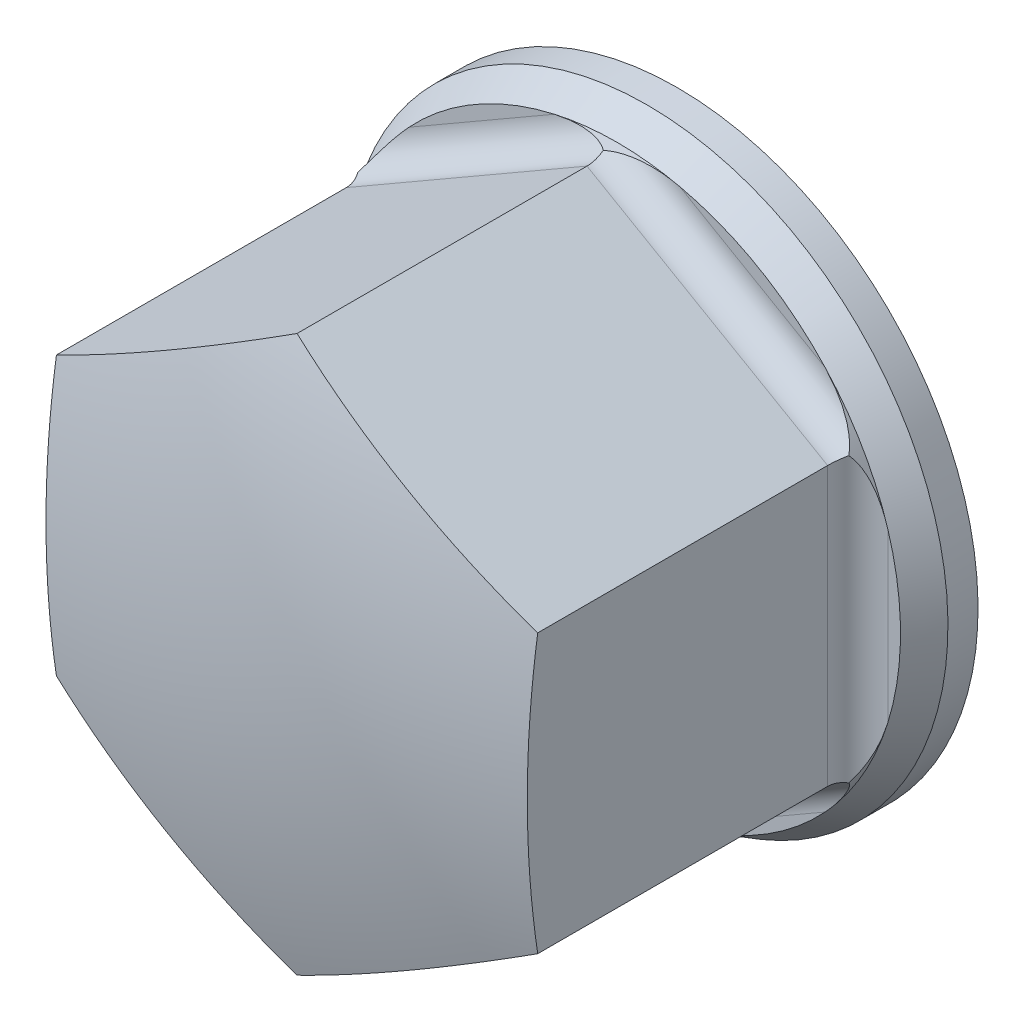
ISO-10303-21;
HEADER;
FILE_DESCRIPTION(('STEP AP214'),'2;1');
FILE_NAME('part.step','',(''),(''),'','','');
FILE_SCHEMA(('AUTOMOTIVE_DESIGN { 1 0 10303 214 1 1 1 1 }'));
ENDSEC;
DATA;
#1=APPLICATION_CONTEXT('core data for automotive mechanical design processes');
#2=APPLICATION_PROTOCOL_DEFINITION('international standard','automotive_design',2000,#1);
#3=PRODUCT_CONTEXT('',#1,'mechanical');
#4=PRODUCT('Part','Part','',(#3));
#5=PRODUCT_RELATED_PRODUCT_CATEGORY('part','',(#4));
#6=PRODUCT_DEFINITION_FORMATION('','',#4);
#7=PRODUCT_DEFINITION_CONTEXT('part definition',#1,'design');
#8=PRODUCT_DEFINITION('design','',#6,#7);
#9=PRODUCT_DEFINITION_SHAPE('','',#8);
#10=(LENGTH_UNIT() NAMED_UNIT(*) SI_UNIT(.MILLI.,.METRE.));
#11=(NAMED_UNIT(*) PLANE_ANGLE_UNIT() SI_UNIT($,.RADIAN.));
#12=(NAMED_UNIT(*) SI_UNIT($,.STERADIAN.) SOLID_ANGLE_UNIT());
#13=UNCERTAINTY_MEASURE_WITH_UNIT(LENGTH_MEASURE(1.E-05),#10,'distance_accuracy_value','');
#14=(GEOMETRIC_REPRESENTATION_CONTEXT(3) GLOBAL_UNCERTAINTY_ASSIGNED_CONTEXT((#13)) GLOBAL_UNIT_ASSIGNED_CONTEXT((#10,
#11,#12)) REPRESENTATION_CONTEXT('',''));
#15=CARTESIAN_POINT('',(0.,0.,0.));
#16=DIRECTION('',(0.,0.,1.));
#17=DIRECTION('',(1.,0.,0.));
#18=AXIS2_PLACEMENT_3D('',#15,#16,#17);
#19=CARTESIAN_POINT('',(0.,0.,0.));
#20=DIRECTION('',(0.,0.,-1.));
#21=DIRECTION('',(0.,1.,0.));
#22=AXIS2_PLACEMENT_3D('',#19,#20,#21);
#23=CYLINDRICAL_SURFACE('',#22,5.);
#24=CARTESIAN_POINT('',(0.,0.,0.));
#25=DIRECTION('',(0.,0.,-1.));
#26=DIRECTION('',(0.,1.,0.));
#27=AXIS2_PLACEMENT_3D('',#24,#25,#26);
#28=CIRCLE('',#27,5.);
#29=CARTESIAN_POINT('',(0.,5.,0.));
#30=VERTEX_POINT('',#29);
#31=EDGE_CURVE('E175',#30,#30,#28,.T.);
#32=ORIENTED_EDGE('',*,*,#31,.F.);
#33=EDGE_LOOP('',(#32));
#34=FACE_BOUND('',#33,.T.);
#35=CARTESIAN_POINT('',(0.,0.,0.5));
#36=DIRECTION('',(0.,0.,-1.));
#37=DIRECTION('',(0.,1.,0.));
#38=AXIS2_PLACEMENT_3D('',#35,#36,#37);
#39=CIRCLE('',#38,5.);
#40=CARTESIAN_POINT('',(0.,5.,0.5));
#41=VERTEX_POINT('',#40);
#42=EDGE_CURVE('E140',#41,#41,#39,.T.);
#43=ORIENTED_EDGE('',*,*,#42,.T.);
#44=EDGE_LOOP('',(#43));
#45=FACE_BOUND('',#44,.T.);
#46=ADVANCED_FACE('F14',(#34,#45),#23,.T.);
#47=CARTESIAN_POINT('',(5.,0.,0.));
#48=DIRECTION('',(0.,0.,1.));
#49=DIRECTION('',(0.,-1.,0.));
#50=AXIS2_PLACEMENT_3D('',#47,#48,#49);
#51=PLANE('',#50);
#52=CARTESIAN_POINT('',(0.,0.,0.));
#53=DIRECTION('',(0.,0.,-1.));
#54=DIRECTION('',(0.,1.,0.));
#55=AXIS2_PLACEMENT_3D('',#52,#53,#54);
#56=CIRCLE('',#55,2.5);
#57=CARTESIAN_POINT('',(0.,2.5,0.));
#58=VERTEX_POINT('',#57);
#59=EDGE_CURVE('E330',#58,#58,#56,.T.);
#60=ORIENTED_EDGE('',*,*,#59,.F.);
#61=EDGE_LOOP('',(#60));
#62=FACE_BOUND('',#61,.T.);
#63=ORIENTED_EDGE('',*,*,#31,.T.);
#64=EDGE_LOOP('',(#63));
#65=FACE_BOUND('',#64,.T.);
#66=ADVANCED_FACE('F314',(#62,#65),#51,.F.);
#67=CARTESIAN_POINT('',(0.,0.,0.5));
#68=DIRECTION('',(0.,0.,-1.));
#69=DIRECTION('',(0.,1.,0.));
#70=AXIS2_PLACEMENT_3D('',#67,#68,#69);
#71=CYLINDRICAL_SURFACE('',#70,4.71132486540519);
#72=CARTESIAN_POINT('',(-4.,-2.48929347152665,1.5));
#73=CARTESIAN_POINT('',(-3.99997918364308,-2.48932287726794,1.48424472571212));
#74=CARTESIAN_POINT('',(-4.00074354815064,-2.48809880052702,1.46852756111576));
#75=CARTESIAN_POINT('',(-4.00366322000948,-2.48339998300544,1.43769489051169));
#76=CARTESIAN_POINT('',(-4.00580690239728,-2.47994405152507,1.42257546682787));
#77=CARTESIAN_POINT('',(-4.01130363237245,-2.47104237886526,1.39322819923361));
#78=CARTESIAN_POINT('',(-4.01465339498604,-2.46560204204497,1.3789980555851));
#79=CARTESIAN_POINT('',(-4.02233194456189,-2.45305576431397,1.35155294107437));
#80=CARTESIAN_POINT('',(-4.02666286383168,-2.44594619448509,1.33834026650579));
#81=CARTESIAN_POINT('',(-4.03907925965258,-2.42541534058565,1.30495689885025));
#82=CARTESIAN_POINT('',(-4.04779819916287,-2.41085964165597,1.28571992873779));
#83=CARTESIAN_POINT('',(-4.06645650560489,-2.37925502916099,1.2501084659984));
#84=CARTESIAN_POINT('',(-4.07639907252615,-2.36219955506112,1.23374176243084));
#85=CARTESIAN_POINT('',(-4.10404035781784,-2.31400950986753,1.19312423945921));
#86=CARTESIAN_POINT('',(-4.12236112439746,-2.28127419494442,1.17121580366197));
#87=CARTESIAN_POINT('',(-4.15942781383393,-2.21297769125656,1.13295888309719));
#88=CARTESIAN_POINT('',(-4.17817464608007,-2.17740995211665,1.11662377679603));
#89=CARTESIAN_POINT('',(-4.21536503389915,-2.10450779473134,1.08826246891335));
#90=CARTESIAN_POINT('',(-4.23380874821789,-2.06717434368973,1.07623393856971));
#91=CARTESIAN_POINT('',(-4.27004013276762,-1.99125911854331,1.05552987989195));
#92=CARTESIAN_POINT('',(-4.28782710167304,-1.95267608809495,1.04685784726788));
#93=CARTESIAN_POINT('',(-4.32255816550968,-1.87454137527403,1.03216421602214));
#94=CARTESIAN_POINT('',(-4.33950025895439,-1.83498769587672,1.02614866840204));
#95=CARTESIAN_POINT('',(-4.37238200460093,-1.75519828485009,1.01625633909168));
#96=CARTESIAN_POINT('',(-4.38832138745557,-1.71496237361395,1.01238012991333));
#97=CARTESIAN_POINT('',(-4.42125584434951,-1.62834627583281,1.00591513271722));
#98=CARTESIAN_POINT('',(-4.43809110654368,-1.58188732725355,1.00357919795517));
#99=CARTESIAN_POINT('',(-4.47019133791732,-1.48875297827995,1.00063569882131));
#100=CARTESIAN_POINT('',(-4.48546687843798,-1.44208163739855,1.00001563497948));
#101=CARTESIAN_POINT('',(-4.5,-1.39519962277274,1.));
#102=B_SPLINE_CURVE_WITH_KNOTS('',3,(#72,#73,#74,#75,#76,#77,#78,#79,#80,#81,#82,#83,#84,#85,
#86,#87,#88,#89,#90,#91,#92,#93,#94,#95,#96,#97,#98,#99,#100,#101),.UNSPECIFIED.,.F.,.F.,(4,2,2,
2,2,2,2,2,2,2,2,2,2,2,4),(0.,0.0471392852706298,0.0938863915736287,0.140507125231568,
0.187230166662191,0.263737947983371,0.340450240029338,0.470043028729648,0.599944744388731,
0.729776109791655,0.85974232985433,0.990003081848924,1.12029867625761,1.26865074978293,
1.41591925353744),.UNSPECIFIED.);
#103=CARTESIAN_POINT('',(-4.08012701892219,-2.3556624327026,1.22851025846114));
#104=VERTEX_POINT('',#103);
#105=CARTESIAN_POINT('',(-4.5,-1.39519962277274,1.));
#106=VERTEX_POINT('',#105);
#107=EDGE_CURVE('E270',#104,#106,#102,.T.);
#108=ORIENTED_EDGE('',*,*,#107,.T.);
#109=CARTESIAN_POINT('',(0.,0.,1.));
#110=DIRECTION('',(0.,0.,-1.));
#111=DIRECTION('',(0.,1.,0.));
#112=AXIS2_PLACEMENT_3D('',#109,#110,#111);
#113=CIRCLE('',#112,4.71132486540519);
#114=CARTESIAN_POINT('',(-3.45827831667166,-3.1995145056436,1.));
#115=VERTEX_POINT('',#114);
#116=EDGE_CURVE('E573',#115,#106,#113,.T.);
#117=ORIENTED_EDGE('',*,*,#116,.F.);
#118=CARTESIAN_POINT('',(-3.45827831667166,-3.1995145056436,1.));
#119=CARTESIAN_POINT('',(-3.49441343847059,-3.16046171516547,1.00002190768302));
#120=CARTESIAN_POINT('',(-3.52989942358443,-3.12077392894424,1.00074736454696));
#121=CARTESIAN_POINT('',(-3.59957617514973,-3.04014366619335,1.00424018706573));
#122=CARTESIAN_POINT('',(-3.63376234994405,-2.99919752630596,1.00701419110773));
#123=CARTESIAN_POINT('',(-3.7006224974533,-2.91630134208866,1.01524905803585));
#124=CARTESIAN_POINT('',(-3.73329570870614,-2.87435080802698,1.02071125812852));
#125=CARTESIAN_POINT('',(-3.79689141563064,-2.78980048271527,1.03517070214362));
#126=CARTESIAN_POINT('',(-3.8278164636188,-2.74720175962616,1.04416263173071));
#127=CARTESIAN_POINT('',(-3.87835249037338,-2.6751177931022,1.06330446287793));
#128=CARTESIAN_POINT('',(-3.89848923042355,-2.64567751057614,1.07222298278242));
#129=CARTESIAN_POINT('',(-3.93772922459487,-2.58691346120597,1.09283245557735));
#130=CARTESIAN_POINT('',(-3.95682903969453,-2.55759034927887,1.10453201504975));
#131=CARTESIAN_POINT('',(-3.99818665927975,-2.49257022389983,1.13459722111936));
#132=CARTESIAN_POINT('',(-4.02008068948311,-2.45706015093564,1.15389240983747));
#133=CARTESIAN_POINT('',(-4.06092993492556,-2.3889274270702,1.19940978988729));
#134=CARTESIAN_POINT('',(-4.07990319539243,-2.35628762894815,1.22558649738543));
#135=CARTESIAN_POINT('',(-4.10358967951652,-2.31459362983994,1.26905204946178));
#136=CARTESIAN_POINT('',(-4.11019504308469,-2.30283258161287,1.28270089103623));
#137=CARTESIAN_POINT('',(-4.12238708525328,-2.28093436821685,1.3116982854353));
#138=CARTESIAN_POINT('',(-4.1279732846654,-2.27079796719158,1.32704763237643));
#139=CARTESIAN_POINT('',(-4.1379074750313,-2.25264577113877,1.35961661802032));
#140=CARTESIAN_POINT('',(-4.14223932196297,-2.24465771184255,1.37685701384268));
#141=CARTESIAN_POINT('',(-4.14922772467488,-2.23171382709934,1.41274118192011));
#142=CARTESIAN_POINT('',(-4.15189013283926,-2.22674741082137,1.43137979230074));
#143=CARTESIAN_POINT('',(-4.15431668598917,-2.22221441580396,1.45855204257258));
#144=CARTESIAN_POINT('',(-4.15486784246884,-2.22118348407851,1.46679129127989));
#145=CARTESIAN_POINT('',(-4.15560561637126,-2.21980276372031,1.48335162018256));
#146=CARTESIAN_POINT('',(-4.15579184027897,-2.21945371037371,1.4916727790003));
#147=CARTESIAN_POINT('',(-4.15579138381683,-2.21945487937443,1.5));
#148=B_SPLINE_CURVE_WITH_KNOTS('',3,(#118,#119,#120,#121,#122,#123,#124,#125,#126,#127,#128,
#129,#130,#131,#132,#133,#134,#135,#136,#137,#138,#139,#140,#141,#142,#143,#144,#145,#146,#147),
.UNSPECIFIED.,.F.,.F.,(4,2,2,2,2,2,2,2,2,2,2,2,2,2,4),(0.,0.159644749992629,0.319809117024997,
0.480053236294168,0.640057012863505,0.750263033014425,0.860814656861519,0.998290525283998,
1.13487963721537,1.19231630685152,1.24977991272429,1.30795319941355,1.36592139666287,
1.39085531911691,1.41581611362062),.UNSPECIFIED.);
#149=EDGE_CURVE('E265',#115,#104,#148,.T.);
#150=ORIENTED_EDGE('',*,*,#149,.T.);
#151=EDGE_LOOP('',(#108,#117,#150));
#152=FACE_BOUND('',#151,.T.);
#153=ADVANCED_FACE('F199',(#152),#71,.T.);
#154=CARTESIAN_POINT('',(4.,2.48929347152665,1.5));
#155=CARTESIAN_POINT('',(3.99997918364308,2.48932287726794,1.48424472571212));
#156=CARTESIAN_POINT('',(4.00074354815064,2.48809880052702,1.46852756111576));
#157=CARTESIAN_POINT('',(4.00366322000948,2.48339998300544,1.43769489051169));
#158=CARTESIAN_POINT('',(4.00580690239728,2.47994405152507,1.42257546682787));
#159=CARTESIAN_POINT('',(4.01130363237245,2.47104237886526,1.39322819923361));
#160=CARTESIAN_POINT('',(4.01465339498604,2.46560204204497,1.3789980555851));
#161=CARTESIAN_POINT('',(4.02233194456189,2.45305576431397,1.35155294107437));
#162=CARTESIAN_POINT('',(4.02666286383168,2.44594619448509,1.33834026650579));
#163=CARTESIAN_POINT('',(4.03907925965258,2.42541534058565,1.30495689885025));
#164=CARTESIAN_POINT('',(4.04779819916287,2.41085964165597,1.28571992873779));
#165=CARTESIAN_POINT('',(4.06645650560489,2.37925502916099,1.2501084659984));
#166=CARTESIAN_POINT('',(4.07639907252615,2.36219955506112,1.23374176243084));
#167=CARTESIAN_POINT('',(4.10404035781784,2.31400950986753,1.19312423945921));
#168=CARTESIAN_POINT('',(4.12236112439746,2.28127419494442,1.17121580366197));
#169=CARTESIAN_POINT('',(4.15942781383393,2.21297769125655,1.13295888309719));
#170=CARTESIAN_POINT('',(4.17817464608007,2.17740995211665,1.11662377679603));
#171=CARTESIAN_POINT('',(4.21536503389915,2.10450779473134,1.08826246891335));
#172=CARTESIAN_POINT('',(4.23380874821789,2.06717434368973,1.07623393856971));
#173=CARTESIAN_POINT('',(4.27004013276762,1.99125911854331,1.05552987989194));
#174=CARTESIAN_POINT('',(4.28782710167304,1.95267608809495,1.04685784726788));
#175=CARTESIAN_POINT('',(4.32255816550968,1.87454137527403,1.03216421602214));
#176=CARTESIAN_POINT('',(4.33950025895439,1.83498769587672,1.02614866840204));
#177=CARTESIAN_POINT('',(4.37238200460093,1.75519828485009,1.01625633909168));
#178=CARTESIAN_POINT('',(4.38832138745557,1.71496237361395,1.01238012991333));
#179=CARTESIAN_POINT('',(4.42125584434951,1.62834627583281,1.00591513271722));
#180=CARTESIAN_POINT('',(4.43809110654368,1.58188732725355,1.00357919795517));
#181=CARTESIAN_POINT('',(4.47019133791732,1.48875297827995,1.00063569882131));
#182=CARTESIAN_POINT('',(4.48546687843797,1.44208163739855,1.00001563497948));
#183=CARTESIAN_POINT('',(4.5,1.39519962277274,1.));
#184=B_SPLINE_CURVE_WITH_KNOTS('',3,(#154,#155,#156,#157,#158,#159,#160,#161,#162,#163,#164,
#165,#166,#167,#168,#169,#170,#171,#172,#173,#174,#175,#176,#177,#178,#179,#180,#181,#182,#183),
.UNSPECIFIED.,.F.,.F.,(4,2,2,2,2,2,2,2,2,2,2,2,2,2,4),(0.,0.0471392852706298,0.0938863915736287,
0.140507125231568,0.187230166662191,0.263737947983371,0.340450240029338,0.47004302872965,
0.599944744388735,0.729776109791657,0.85974232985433,0.990003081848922,1.1202986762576,
1.26865074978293,1.41591925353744),.UNSPECIFIED.);
#185=CARTESIAN_POINT('',(4.08012701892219,2.35566243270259,1.22851025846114));
#186=VERTEX_POINT('',#185);
#187=CARTESIAN_POINT('',(4.5,1.39519962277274,1.));
#188=VERTEX_POINT('',#187);
#189=EDGE_CURVE('E259',#186,#188,#184,.T.);
#190=ORIENTED_EDGE('',*,*,#189,.T.);
#191=CARTESIAN_POINT('',(3.45827831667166,3.1995145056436,1.));
#192=VERTEX_POINT('',#191);
#193=EDGE_CURVE('E136',#192,#188,#113,.T.);
#194=ORIENTED_EDGE('',*,*,#193,.F.);
#195=CARTESIAN_POINT('',(3.45827831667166,3.19951450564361,1.));
#196=CARTESIAN_POINT('',(3.49441343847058,3.16046171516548,1.00002190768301));
#197=CARTESIAN_POINT('',(3.52989942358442,3.12077392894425,1.00074736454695));
#198=CARTESIAN_POINT('',(3.59957617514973,3.04014366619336,1.00424018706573));
#199=CARTESIAN_POINT('',(3.63376234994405,2.99919752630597,1.00701419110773));
#200=CARTESIAN_POINT('',(3.7006224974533,2.91630134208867,1.01524905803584));
#201=CARTESIAN_POINT('',(3.73329570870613,2.87435080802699,1.02071125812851));
#202=CARTESIAN_POINT('',(3.79689141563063,2.78980048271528,1.03517070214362));
#203=CARTESIAN_POINT('',(3.82781646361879,2.74720175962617,1.04416263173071));
#204=CARTESIAN_POINT('',(3.87835249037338,2.6751177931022,1.06330446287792));
#205=CARTESIAN_POINT('',(3.89848923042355,2.64567751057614,1.0722229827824));
#206=CARTESIAN_POINT('',(3.93772922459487,2.58691346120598,1.09283245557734));
#207=CARTESIAN_POINT('',(3.95682903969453,2.55759034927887,1.10453201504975));
#208=CARTESIAN_POINT('',(3.99818665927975,2.49257022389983,1.13459722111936));
#209=CARTESIAN_POINT('',(4.02008068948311,2.45706015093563,1.15389240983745));
#210=CARTESIAN_POINT('',(4.06092993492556,2.3889274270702,1.19940978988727));
#211=CARTESIAN_POINT('',(4.07990319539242,2.35628762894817,1.22558649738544));
#212=CARTESIAN_POINT('',(4.10358967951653,2.31459362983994,1.26905204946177));
#213=CARTESIAN_POINT('',(4.1101950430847,2.30283258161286,1.28270089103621));
#214=CARTESIAN_POINT('',(4.12238708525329,2.28093436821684,1.31169828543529));
#215=CARTESIAN_POINT('',(4.1279732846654,2.27079796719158,1.32704763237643));
#216=CARTESIAN_POINT('',(4.1379074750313,2.25264577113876,1.35961661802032));
#217=CARTESIAN_POINT('',(4.14223932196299,2.24465771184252,1.37685701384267));
#218=CARTESIAN_POINT('',(4.14922772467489,2.23171382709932,1.4127411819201));
#219=CARTESIAN_POINT('',(4.15189013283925,2.22674741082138,1.43137979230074));
#220=CARTESIAN_POINT('',(4.15431668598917,2.22221441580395,1.45855204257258));
#221=CARTESIAN_POINT('',(4.15486784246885,2.22118348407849,1.46679129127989));
#222=CARTESIAN_POINT('',(4.15560561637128,2.21980276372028,1.48335162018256));
#223=CARTESIAN_POINT('',(4.15579184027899,2.21945371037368,1.49167277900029));
#224=CARTESIAN_POINT('',(4.15579138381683,2.21945487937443,1.5));
#225=B_SPLINE_CURVE_WITH_KNOTS('',3,(#195,#196,#197,#198,#199,#200,#201,#202,#203,#204,#205,
#206,#207,#208,#209,#210,#211,#212,#213,#214,#215,#216,#217,#218,#219,#220,#221,#222,#223,#224),
.UNSPECIFIED.,.F.,.F.,(4,2,2,2,2,2,2,2,2,2,2,2,2,2,4),(0.,0.159644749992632,0.319809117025,
0.480053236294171,0.640057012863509,0.750263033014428,0.860814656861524,0.998290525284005,
1.13487963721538,1.19231630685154,1.24977991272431,1.30795319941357,1.3659213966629,
1.39085531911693,1.41581611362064),.UNSPECIFIED.);
#226=EDGE_CURVE('E253',#192,#186,#225,.T.);
#227=ORIENTED_EDGE('',*,*,#226,.T.);
#228=EDGE_LOOP('',(#190,#194,#227));
#229=FACE_BOUND('',#228,.T.);
#230=ADVANCED_FACE('F483',(#229),#71,.T.);
#231=CARTESIAN_POINT('',(-4.5,1.39519962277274,1.));
#232=CARTESIAN_POINT('',(-4.48424685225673,1.44601995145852,1.00002190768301));
#233=CARTESIAN_POINT('',(-4.4676192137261,1.49659560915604,1.00074736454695));
#234=CARTESIAN_POINT('',(-4.43262973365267,1.59725257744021,1.00424018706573));
#235=CARTESIAN_POINT('',(-4.41426242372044,1.647331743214,1.00701419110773));
#236=CARTESIAN_POINT('',(-4.37590229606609,1.74668242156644,1.01524905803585));
#237=CARTESIAN_POINT('',(-4.35590867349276,1.79595351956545,1.02071125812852));
#238=CARTESIAN_POINT('',(-4.31448379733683,1.89330417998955,1.03517070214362));
#239=CARTESIAN_POINT('',(-4.29305474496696,1.9413854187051,1.04416263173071));
#240=CARTESIAN_POINT('',(-4.25589621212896,2.02119288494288,1.06330446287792));
#241=CARTESIAN_POINT('',(-4.24046854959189,2.05335195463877,1.07222298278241));
#242=CARTESIAN_POINT('',(-4.20919738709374,2.11671681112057,1.09283245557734));
#243=CARTESIAN_POINT('',(-4.19335273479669,2.14791929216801,1.10453201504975));
#244=CARTESIAN_POINT('',(-4.15772246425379,2.21624610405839,1.13459722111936));
#245=CARTESIAN_POINT('',(-4.13791685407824,2.25296192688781,1.15389240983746));
#246=CARTESIAN_POINT('',(-4.09933680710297,2.32240477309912,1.19940978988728));
#247=CARTESIAN_POINT('',(-4.08055654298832,2.35515599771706,1.22558649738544));
#248=CARTESIAN_POINT('',(-4.05629172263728,2.39651609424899,1.26905204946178));
#249=CARTESIAN_POINT('',(-4.04940903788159,2.40811703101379,1.28270089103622));
#250=CARTESIAN_POINT('',(-4.03654064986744,2.42962475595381,1.31169828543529));
#251=CARTESIAN_POINT('',(-4.03055536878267,2.43953074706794,1.32704763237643));
#252=CARTESIAN_POINT('',(-4.0198022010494,2.45721010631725,1.35961661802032));
#253=CARTESIAN_POINT('',(-4.01505026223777,2.46495562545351,1.37685701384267));
#254=CARTESIAN_POINT('',(-4.00733473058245,2.4774797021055,1.4127411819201));
#255=CARTESIAN_POINT('',(-4.00436489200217,2.48226862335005,1.43137979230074));
#256=CARTESIAN_POINT('',(-4.0016524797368,2.48663657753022,1.45855204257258));
#257=CARTESIAN_POINT('',(-4.00103524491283,2.48762935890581,1.46679129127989));
#258=CARTESIAN_POINT('',(-4.00020839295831,2.48895865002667,1.48335162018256));
#259=CARTESIAN_POINT('',(-3.99999921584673,2.48929445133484,1.49167277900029));
#260=CARTESIAN_POINT('',(-4.,2.48929347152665,1.5));
#261=B_SPLINE_CURVE_WITH_KNOTS('',3,(#231,#232,#233,#234,#235,#236,#237,#238,#239,#240,#241,
#242,#243,#244,#245,#246,#247,#248,#249,#250,#251,#252,#253,#254,#255,#256,#257,#258,#259,#260),
.UNSPECIFIED.,.F.,.F.,(4,2,2,2,2,2,2,2,2,2,2,2,2,2,4),(0.,0.159644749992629,0.319809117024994,
0.480053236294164,0.640057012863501,0.750263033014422,0.860814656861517,0.998290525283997,
1.13487963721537,1.19231630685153,1.2497799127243,1.30795319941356,1.36592139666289,
1.39085531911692,1.41581611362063),.UNSPECIFIED.);
#262=CARTESIAN_POINT('',(-4.5,1.39519962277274,1.));
#263=VERTEX_POINT('',#262);
#264=CARTESIAN_POINT('',(-4.0801270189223,2.35566243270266,1.22851025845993));
#265=VERTEX_POINT('',#264);
#266=EDGE_CURVE('E245',#263,#265,#261,.T.);
#267=ORIENTED_EDGE('',*,*,#266,.T.);
#268=CARTESIAN_POINT('',(-4.15579138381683,2.21945487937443,1.5));
#269=CARTESIAN_POINT('',(-4.15580644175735,2.21942214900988,1.48424472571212));
#270=CARTESIAN_POINT('',(-4.15512854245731,2.22069614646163,1.46852756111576));
#271=CARTESIAN_POINT('',(-4.15251908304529,2.22557406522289,1.43769489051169));
#272=CARTESIAN_POINT('',(-4.15059799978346,2.22915851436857,1.42257546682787));
#273=CARTESIAN_POINT('',(-4.14563729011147,2.2383696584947,1.39322819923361));
#274=CARTESIAN_POINT('',(-4.14260070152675,2.24399080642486,1.3789980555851));
#275=CARTESIAN_POINT('',(-4.1355745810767,2.25691376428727,1.35155294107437));
#276=CARTESIAN_POINT('',(-4.1315829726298,2.26421923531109,1.33834026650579));
#277=CARTESIAN_POINT('',(-4.12001092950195,2.28523757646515,1.30495689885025));
#278=CARTESIAN_POINT('',(-4.11176479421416,2.30006624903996,1.28571992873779));
#279=CARTESIAN_POINT('',(-4.09372355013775,2.33202712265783,1.25010846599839));
#280=CARTESIAN_POINT('',(-4.0839243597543,2.34916537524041,1.23374176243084));
#281=CARTESIAN_POINT('',(-4.05601119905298,2.39719845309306,1.19312423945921));
#282=CARTESIAN_POINT('',(-4.03682196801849,2.42943235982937,1.17121580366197));
#283=CARTESIAN_POINT('',(-3.99620880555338,2.49568130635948,1.13295888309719));
#284=CARTESIAN_POINT('',(-3.97477965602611,2.52970040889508,1.11662377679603));
#285=CARTESIAN_POINT('',(-3.93023972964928,2.59835930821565,1.08826246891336));
#286=CARTESIAN_POINT('',(-3.90712986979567,2.63299875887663,1.0762339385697));
#287=CARTESIAN_POINT('',(-3.85950104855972,2.70233367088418,1.05552987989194));
#288=CARTESIAN_POINT('',(-3.83498064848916,2.73702915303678,1.04685784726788));
#289=CARTESIAN_POINT('',(-3.78467953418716,2.80617449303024,1.03216421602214));
#290=CARTESIAN_POINT('',(-3.75889608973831,2.8406236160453,1.02614866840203));
#291=CARTESIAN_POINT('',(-3.70623730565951,2.9089947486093,1.01625633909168));
#292=CARTESIAN_POINT('',(-3.67936167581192,2.94291661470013,1.01238012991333));
#293=CARTESIAN_POINT('',(-3.62081716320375,3.0147467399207,1.00591513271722));
#294=CARTESIAN_POINT('',(-3.58900016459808,3.05255597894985,1.00357919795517));
#295=CARTESIAN_POINT('',(-3.52439356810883,3.12692276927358,1.00063569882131));
#296=CARTESIAN_POINT('',(-3.49161277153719,3.1634874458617,1.00001563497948));
#297=CARTESIAN_POINT('',(-3.45827831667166,3.19951450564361,1.));
#298=B_SPLINE_CURVE_WITH_KNOTS('',3,(#268,#269,#270,#271,#272,#273,#274,#275,#276,#277,#278,
#279,#280,#281,#282,#283,#284,#285,#286,#287,#288,#289,#290,#291,#292,#293,#294,#295,#296,#297),
.UNSPECIFIED.,.F.,.F.,(4,2,2,2,2,2,2,2,2,2,2,2,2,2,4),(0.,0.0471392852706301,0.0938863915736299,
0.140507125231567,0.187230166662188,0.26373794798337,0.340450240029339,0.470043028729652,
0.599944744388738,0.729776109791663,0.859742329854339,0.990003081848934,1.12029867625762,
1.26865074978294,1.41591925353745),.UNSPECIFIED.);
#299=CARTESIAN_POINT('',(-3.45827831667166,3.19951450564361,1.));
#300=VERTEX_POINT('',#299);
#301=EDGE_CURVE('E238',#265,#300,#298,.T.);
#302=ORIENTED_EDGE('',*,*,#301,.T.);
#303=EDGE_CURVE('E587',#263,#300,#113,.T.);
#304=ORIENTED_EDGE('',*,*,#303,.F.);
#305=EDGE_LOOP('',(#267,#302,#304));
#306=FACE_BOUND('',#305,.T.);
#307=ADVANCED_FACE('F476',(#306),#71,.T.);
#308=CARTESIAN_POINT('',(-0.155791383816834,4.70874835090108,1.5));
#309=CARTESIAN_POINT('',(-0.155827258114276,4.70874502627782,1.48424472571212));
#310=CARTESIAN_POINT('',(-0.154384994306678,4.70879494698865,1.46852756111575));
#311=CARTESIAN_POINT('',(-0.148855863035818,4.70897404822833,1.43769489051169));
#312=CARTESIAN_POINT('',(-0.144791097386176,4.70910256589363,1.42257546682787));
#313=CARTESIAN_POINT('',(-0.134333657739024,4.70941203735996,1.39322819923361));
#314=CARTESIAN_POINT('',(-0.127947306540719,4.70959284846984,1.3789980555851));
#315=CARTESIAN_POINT('',(-0.113242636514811,4.70996952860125,1.35155294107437));
#316=CARTESIAN_POINT('',(-0.104920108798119,4.71016542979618,1.33834026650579));
#317=CARTESIAN_POINT('',(-0.0809316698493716,4.7106529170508,1.30495689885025));
#318=CARTESIAN_POINT('',(-0.0639665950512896,4.71092589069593,1.28571992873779));
#319=CARTESIAN_POINT('',(-0.0272670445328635,4.71128215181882,1.25010846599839));
#320=CARTESIAN_POINT('',(-0.00752528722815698,4.71136493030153,1.23374176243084));
#321=CARTESIAN_POINT('',(0.048029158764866,4.71120796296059,1.19312423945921));
#322=CARTESIAN_POINT('',(0.0855391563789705,4.71070655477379,1.17121580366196));
#323=CARTESIAN_POINT('',(0.163219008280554,4.70865899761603,1.13295888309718));
#324=CARTESIAN_POINT('',(0.203394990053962,4.70711036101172,1.11662377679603));
#325=CARTESIAN_POINT('',(0.285125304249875,4.70286710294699,1.08826246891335));
#326=CARTESIAN_POINT('',(0.326678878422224,4.70017310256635,1.0762339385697));
#327=CARTESIAN_POINT('',(0.410539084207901,4.69359278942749,1.05552987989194));
#328=CARTESIAN_POINT('',(0.452846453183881,4.68970524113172,1.04685784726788));
#329=CARTESIAN_POINT('',(0.537878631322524,4.68071586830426,1.03216421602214));
#330=CARTESIAN_POINT('',(0.580604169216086,4.67561131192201,1.02614866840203));
#331=CARTESIAN_POINT('',(0.666144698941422,4.66419303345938,1.01625633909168));
#332=CARTESIAN_POINT('',(0.708959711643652,4.65787898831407,1.01238012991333));
#333=CARTESIAN_POINT('',(0.800438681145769,4.6430930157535,1.00591513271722));
#334=CARTESIAN_POINT('',(0.849090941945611,4.63444330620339,1.00357919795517));
#335=CARTESIAN_POINT('',(0.945797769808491,4.61567574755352,1.00063569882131));
#336=CARTESIAN_POINT('',(0.99385410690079,4.60556908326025,1.00001563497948));
#337=CARTESIAN_POINT('',(1.04172168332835,4.59471412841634,1.));
#338=B_SPLINE_CURVE_WITH_KNOTS('',3,(#308,#309,#310,#311,#312,#313,#314,#315,#316,#317,#318,
#319,#320,#321,#322,#323,#324,#325,#326,#327,#328,#329,#330,#331,#332,#333,#334,#335,#336,#337),
.UNSPECIFIED.,.F.,.F.,(4,2,2,2,2,2,2,2,2,2,2,2,2,2,4),(0.,0.0471392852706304,0.0938863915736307,
0.14050712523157,0.187230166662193,0.263737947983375,0.340450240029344,0.470043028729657,
0.599944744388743,0.729776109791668,0.859742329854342,0.990003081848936,1.12029867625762,
1.26865074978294,1.41591925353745),.UNSPECIFIED.);
#339=CARTESIAN_POINT('',(0.,4.71132486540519,1.22851025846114));
#340=VERTEX_POINT('',#339);
#341=CARTESIAN_POINT('',(1.04172168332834,4.59471412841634,1.));
#342=VERTEX_POINT('',#341);
#343=EDGE_CURVE('E230',#340,#342,#338,.T.);
#344=ORIENTED_EDGE('',*,*,#343,.T.);
#345=CARTESIAN_POINT('',(-1.04172168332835,4.59471412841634,1.));
#346=VERTEX_POINT('',#345);
#347=EDGE_CURVE('E653',#346,#342,#113,.T.);
#348=ORIENTED_EDGE('',*,*,#347,.F.);
#349=CARTESIAN_POINT('',(-1.04172168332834,4.59471412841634,1.));
#350=CARTESIAN_POINT('',(-0.989833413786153,4.60648166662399,1.00002190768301));
#351=CARTESIAN_POINT('',(-0.937719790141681,4.61736953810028,1.00074736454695));
#352=CARTESIAN_POINT('',(-0.833053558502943,4.63739624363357,1.00424018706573));
#353=CARTESIAN_POINT('',(-0.780500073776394,4.64652926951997,1.00701419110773));
#354=CARTESIAN_POINT('',(-0.675279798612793,4.6629837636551,1.01524905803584));
#355=CARTESIAN_POINT('',(-0.622612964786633,4.67030432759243,1.02071125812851));
#356=CARTESIAN_POINT('',(-0.517592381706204,4.68310466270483,1.03517070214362));
#357=CARTESIAN_POINT('',(-0.465238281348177,4.68858717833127,1.04416263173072));
#358=CARTESIAN_POINT('',(-0.377543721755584,4.69631067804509,1.06330446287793));
#359=CARTESIAN_POINT('',(-0.341979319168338,4.69902946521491,1.07222298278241));
#360=CARTESIAN_POINT('',(-0.271468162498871,4.70363027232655,1.09283245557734));
#361=CARTESIAN_POINT('',(-0.236523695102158,4.70550964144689,1.10453201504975));
#362=CARTESIAN_POINT('',(-0.159535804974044,4.70881632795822,1.13459722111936));
#363=CARTESIAN_POINT('',(-0.117836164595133,4.71002207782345,1.15389240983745));
#364=CARTESIAN_POINT('',(-0.0384068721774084,4.71133220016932,1.19940978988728));
#365=CARTESIAN_POINT('',(-0.000653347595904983,4.71144362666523,1.22558649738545));
#366=CARTESIAN_POINT('',(0.0472979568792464,4.71110972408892,1.26905204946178));
#367=CARTESIAN_POINT('',(0.0607860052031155,4.71094961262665,1.28270089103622));
#368=CARTESIAN_POINT('',(0.0858464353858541,4.71055912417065,1.31169828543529));
#369=CARTESIAN_POINT('',(0.097417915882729,4.71032871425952,1.32704763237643));
#370=CARTESIAN_POINT('',(0.118105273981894,4.70985587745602,1.35961661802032));
#371=CARTESIAN_POINT('',(0.12718905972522,4.70961333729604,1.37685701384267));
#372=CARTESIAN_POINT('',(0.141892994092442,4.70919352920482,1.41274118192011));
#373=CARTESIAN_POINT('',(0.147525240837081,4.70901603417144,1.43137979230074));
#374=CARTESIAN_POINT('',(0.152664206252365,4.70885099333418,1.45855204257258));
#375=CARTESIAN_POINT('',(0.153832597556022,4.70881284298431,1.46679129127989));
#376=CARTESIAN_POINT('',(0.155397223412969,4.70876141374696,1.48335162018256));
#377=CARTESIAN_POINT('',(0.155792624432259,4.70874816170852,1.49167277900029));
#378=CARTESIAN_POINT('',(0.155791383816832,4.70874835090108,1.5));
#379=B_SPLINE_CURVE_WITH_KNOTS('',3,(#349,#350,#351,#352,#353,#354,#355,#356,#357,#358,#359,
#360,#361,#362,#363,#364,#365,#366,#367,#368,#369,#370,#371,#372,#373,#374,#375,#376,#377,#378),
.UNSPECIFIED.,.F.,.F.,(4,2,2,2,2,2,2,2,2,2,2,2,2,2,4),(0.,0.15964474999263,0.319809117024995,
0.480053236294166,0.640057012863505,0.750263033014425,0.86081465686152,0.998290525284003,
1.13487963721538,1.19231630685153,1.24977991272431,1.30795319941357,1.36592139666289,
1.39085531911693,1.41581611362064),.UNSPECIFIED.);
#380=EDGE_CURVE('E223',#346,#340,#379,.T.);
#381=ORIENTED_EDGE('',*,*,#380,.T.);
#382=EDGE_LOOP('',(#344,#348,#381));
#383=FACE_BOUND('',#382,.T.);
#384=ADVANCED_FACE('F469',(#383),#71,.T.);
#385=CARTESIAN_POINT('',(0.155791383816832,-4.70874835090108,1.5));
#386=CARTESIAN_POINT('',(0.155827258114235,-4.70874502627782,1.48424472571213));
#387=CARTESIAN_POINT('',(0.154384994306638,-4.70879494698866,1.46852756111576));
#388=CARTESIAN_POINT('',(0.148855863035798,-4.70897404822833,1.43769489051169));
#389=CARTESIAN_POINT('',(0.144791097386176,-4.70910256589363,1.42257546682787));
#390=CARTESIAN_POINT('',(0.134333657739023,-4.70941203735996,1.39322819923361));
#391=CARTESIAN_POINT('',(0.127947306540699,-4.70959284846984,1.37899805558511));
#392=CARTESIAN_POINT('',(0.113242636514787,-4.70996952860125,1.35155294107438));
#393=CARTESIAN_POINT('',(0.104920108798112,-4.71016542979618,1.33834026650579));
#394=CARTESIAN_POINT('',(0.0809316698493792,-4.7106529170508,1.30495689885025));
#395=CARTESIAN_POINT('',(0.063966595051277,-4.71092589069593,1.2857199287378));
#396=CARTESIAN_POINT('',(0.0272670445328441,-4.71128215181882,1.25010846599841));
#397=CARTESIAN_POINT('',(0.00752528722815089,-4.71136493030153,1.23374176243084));
#398=CARTESIAN_POINT('',(-0.0480291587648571,-4.71120796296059,1.19312423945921));
#399=CARTESIAN_POINT('',(-0.0855391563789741,-4.71070655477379,1.17121580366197));
#400=CARTESIAN_POINT('',(-0.163219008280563,-4.70865899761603,1.1329588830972));
#401=CARTESIAN_POINT('',(-0.203394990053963,-4.70711036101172,1.11662377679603));
#402=CARTESIAN_POINT('',(-0.28512530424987,-4.70286710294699,1.08826246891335));
#403=CARTESIAN_POINT('',(-0.326678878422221,-4.70017310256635,1.07623393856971));
#404=CARTESIAN_POINT('',(-0.410539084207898,-4.69359278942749,1.05552987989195));
#405=CARTESIAN_POINT('',(-0.452846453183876,-4.68970524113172,1.04685784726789));
#406=CARTESIAN_POINT('',(-0.537878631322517,-4.68071586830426,1.03216421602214));
#407=CARTESIAN_POINT('',(-0.580604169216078,-4.67561131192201,1.02614866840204));
#408=CARTESIAN_POINT('',(-0.666144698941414,-4.66419303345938,1.01625633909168));
#409=CARTESIAN_POINT('',(-0.708959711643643,-4.65787898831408,1.01238012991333));
#410=CARTESIAN_POINT('',(-0.80043868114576,-4.64309301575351,1.00591513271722));
#411=CARTESIAN_POINT('',(-0.849090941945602,-4.6344433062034,1.00357919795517));
#412=CARTESIAN_POINT('',(-0.945797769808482,-4.61567574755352,1.00063569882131));
#413=CARTESIAN_POINT('',(-0.993854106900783,-4.60556908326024,1.00001563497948));
#414=CARTESIAN_POINT('',(-1.04172168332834,-4.59471412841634,1.));
#415=B_SPLINE_CURVE_WITH_KNOTS('',3,(#385,#386,#387,#388,#389,#390,#391,#392,#393,#394,#395,
#396,#397,#398,#399,#400,#401,#402,#403,#404,#405,#406,#407,#408,#409,#410,#411,#412,#413,#414),
.UNSPECIFIED.,.F.,.F.,(4,2,2,2,2,2,2,2,2,2,2,2,2,2,4),(0.,0.0471392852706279,0.0938863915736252,
0.140507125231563,0.187230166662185,0.263737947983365,0.340450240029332,0.470043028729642,
0.599944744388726,0.729776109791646,0.85974232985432,0.990003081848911,1.12029867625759,
1.26865074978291,1.41591925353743),.UNSPECIFIED.);
#416=CARTESIAN_POINT('',(0.,-4.71132486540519,1.22851025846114));
#417=VERTEX_POINT('',#416);
#418=CARTESIAN_POINT('',(-1.04172168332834,-4.59471412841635,1.));
#419=VERTEX_POINT('',#418);
#420=EDGE_CURVE('E151',#417,#419,#415,.T.);
#421=ORIENTED_EDGE('',*,*,#420,.T.);
#422=CARTESIAN_POINT('',(1.04172168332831,-4.59471412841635,1.));
#423=VERTEX_POINT('',#422);
#424=EDGE_CURVE('E594',#423,#419,#113,.T.);
#425=ORIENTED_EDGE('',*,*,#424,.F.);
#426=CARTESIAN_POINT('',(1.04172168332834,-4.59471412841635,1.));
#427=CARTESIAN_POINT('',(0.989833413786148,-4.606481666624,1.00002190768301));
#428=CARTESIAN_POINT('',(0.937719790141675,-4.61736953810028,1.00074736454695));
#429=CARTESIAN_POINT('',(0.833053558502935,-4.63739624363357,1.00424018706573));
#430=CARTESIAN_POINT('',(0.780500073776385,-4.64652926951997,1.00701419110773));
#431=CARTESIAN_POINT('',(0.675279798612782,-4.66298376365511,1.01524905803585));
#432=CARTESIAN_POINT('',(0.622612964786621,-4.67030432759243,1.02071125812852));
#433=CARTESIAN_POINT('',(0.517592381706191,-4.68310466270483,1.03517070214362));
#434=CARTESIAN_POINT('',(0.465238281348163,-4.68858717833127,1.04416263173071));
#435=CARTESIAN_POINT('',(0.377543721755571,-4.69631067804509,1.06330446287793));
#436=CARTESIAN_POINT('',(0.341979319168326,-4.69902946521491,1.07222298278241));
#437=CARTESIAN_POINT('',(0.271468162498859,-4.70363027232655,1.09283245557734));
#438=CARTESIAN_POINT('',(0.236523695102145,-4.70550964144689,1.10453201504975));
#439=CARTESIAN_POINT('',(0.159535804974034,-4.70881632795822,1.13459722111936));
#440=CARTESIAN_POINT('',(0.117836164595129,-4.71002207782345,1.15389240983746));
#441=CARTESIAN_POINT('',(0.0384068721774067,-4.71133220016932,1.19940978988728));
#442=CARTESIAN_POINT('',(0.000653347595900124,-4.71144362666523,1.22558649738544));
#443=CARTESIAN_POINT('',(-0.0472979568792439,-4.71110972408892,1.26905204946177));
#444=CARTESIAN_POINT('',(-0.0607860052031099,-4.71094961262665,1.28270089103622));
#445=CARTESIAN_POINT('',(-0.0858464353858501,-4.71055912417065,1.31169828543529));
#446=CARTESIAN_POINT('',(-0.0974179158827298,-4.71032871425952,1.32704763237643));
#447=CARTESIAN_POINT('',(-0.118105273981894,-4.70985587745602,1.35961661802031));
#448=CARTESIAN_POINT('',(-0.127189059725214,-4.70961333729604,1.37685701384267));
#449=CARTESIAN_POINT('',(-0.141892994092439,-4.70919352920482,1.4127411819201));
#450=CARTESIAN_POINT('',(-0.147525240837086,-4.70901603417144,1.43137979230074));
#451=CARTESIAN_POINT('',(-0.152664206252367,-4.70885099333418,1.45855204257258));
#452=CARTESIAN_POINT('',(-0.153832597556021,-4.70881284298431,1.46679129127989));
#453=CARTESIAN_POINT('',(-0.155397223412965,-4.70876141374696,1.48335162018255));
#454=CARTESIAN_POINT('',(-0.155792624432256,-4.70874816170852,1.49167277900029));
#455=CARTESIAN_POINT('',(-0.155791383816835,-4.70874835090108,1.5));
#456=B_SPLINE_CURVE_WITH_KNOTS('',3,(#426,#427,#428,#429,#430,#431,#432,#433,#434,#435,#436,
#437,#438,#439,#440,#441,#442,#443,#444,#445,#446,#447,#448,#449,#450,#451,#452,#453,#454,#455),
.UNSPECIFIED.,.F.,.F.,(4,2,2,2,2,2,2,2,2,2,2,2,2,2,4),(0.,0.159644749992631,0.319809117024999,
0.480053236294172,0.640057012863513,0.750263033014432,0.860814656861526,0.998290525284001,
1.13487963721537,1.19231630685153,1.2497799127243,1.30795319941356,1.36592139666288,
1.39085531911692,1.41581611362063),.UNSPECIFIED.);
#457=EDGE_CURVE('E9',#423,#417,#456,.T.);
#458=ORIENTED_EDGE('',*,*,#457,.T.);
#459=EDGE_LOOP('',(#421,#425,#458));
#460=FACE_BOUND('',#459,.T.);
#461=ADVANCED_FACE('F198',(#460),#71,.T.);
#462=CARTESIAN_POINT('',(4.5,-1.39519962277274,1.));
#463=CARTESIAN_POINT('',(4.48424685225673,-1.44601995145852,1.00002190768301));
#464=CARTESIAN_POINT('',(4.4676192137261,-1.49659560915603,1.00074736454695));
#465=CARTESIAN_POINT('',(4.43262973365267,-1.59725257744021,1.00424018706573));
#466=CARTESIAN_POINT('',(4.41426242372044,-1.647331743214,1.00701419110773));
#467=CARTESIAN_POINT('',(4.37590229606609,-1.74668242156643,1.01524905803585));
#468=CARTESIAN_POINT('',(4.35590867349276,-1.79595351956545,1.02071125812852));
#469=CARTESIAN_POINT('',(4.31448379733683,-1.89330417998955,1.03517070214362));
#470=CARTESIAN_POINT('',(4.29305474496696,-1.9413854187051,1.04416263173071));
#471=CARTESIAN_POINT('',(4.25589621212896,-2.02119288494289,1.06330446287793));
#472=CARTESIAN_POINT('',(4.24046854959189,-2.05335195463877,1.07222298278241));
#473=CARTESIAN_POINT('',(4.20919738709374,-2.11671681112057,1.09283245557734));
#474=CARTESIAN_POINT('',(4.19335273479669,-2.14791929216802,1.10453201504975));
#475=CARTESIAN_POINT('',(4.1577224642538,-2.21624610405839,1.13459722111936));
#476=CARTESIAN_POINT('',(4.13791685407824,-2.25296192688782,1.15389240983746));
#477=CARTESIAN_POINT('',(4.09933680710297,-2.32240477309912,1.19940978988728));
#478=CARTESIAN_POINT('',(4.08055654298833,-2.35515599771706,1.22558649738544));
#479=CARTESIAN_POINT('',(4.05629172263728,-2.39651609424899,1.26905204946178));
#480=CARTESIAN_POINT('',(4.04940903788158,-2.40811703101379,1.28270089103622));
#481=CARTESIAN_POINT('',(4.03654064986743,-2.42962475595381,1.31169828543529));
#482=CARTESIAN_POINT('',(4.03055536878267,-2.43953074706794,1.32704763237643));
#483=CARTESIAN_POINT('',(4.01980220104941,-2.45721010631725,1.35961661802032));
#484=CARTESIAN_POINT('',(4.01505026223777,-2.46495562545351,1.37685701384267));
#485=CARTESIAN_POINT('',(4.00733473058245,-2.4774797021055,1.41274118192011));
#486=CARTESIAN_POINT('',(4.00436489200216,-2.48226862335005,1.43137979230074));
#487=CARTESIAN_POINT('',(4.0016524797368,-2.48663657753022,1.45855204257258));
#488=CARTESIAN_POINT('',(4.00103524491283,-2.48762935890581,1.46679129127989));
#489=CARTESIAN_POINT('',(4.00020839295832,-2.48895865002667,1.48335162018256));
#490=CARTESIAN_POINT('',(3.99999921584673,-2.48929445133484,1.49167277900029));
#491=CARTESIAN_POINT('',(4.,-2.48929347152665,1.5));
#492=B_SPLINE_CURVE_WITH_KNOTS('',3,(#462,#463,#464,#465,#466,#467,#468,#469,#470,#471,#472,
#473,#474,#475,#476,#477,#478,#479,#480,#481,#482,#483,#484,#485,#486,#487,#488,#489,#490,#491),
.UNSPECIFIED.,.F.,.F.,(4,2,2,2,2,2,2,2,2,2,2,2,2,2,4),(0.,0.159644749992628,0.319809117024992,
0.480053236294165,0.640057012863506,0.750263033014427,0.860814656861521,0.998290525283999,
1.13487963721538,1.19231630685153,1.2497799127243,1.30795319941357,1.36592139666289,
1.39085531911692,1.41581611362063),.UNSPECIFIED.);
#493=CARTESIAN_POINT('',(4.5,-1.39519962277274,1.));
#494=VERTEX_POINT('',#493);
#495=CARTESIAN_POINT('',(4.0801270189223,-2.35566243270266,1.22851025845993));
#496=VERTEX_POINT('',#495);
#497=EDGE_CURVE('E35',#494,#496,#492,.T.);
#498=ORIENTED_EDGE('',*,*,#497,.T.);
#499=CARTESIAN_POINT('',(4.15579138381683,-2.21945487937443,1.5));
#500=CARTESIAN_POINT('',(4.15580644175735,-2.21942214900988,1.48424472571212));
#501=CARTESIAN_POINT('',(4.15512854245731,-2.22069614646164,1.46852756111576));
#502=CARTESIAN_POINT('',(4.15251908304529,-2.22557406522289,1.43769489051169));
#503=CARTESIAN_POINT('',(4.15059799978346,-2.22915851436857,1.42257546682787));
#504=CARTESIAN_POINT('',(4.14563729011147,-2.23836965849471,1.39322819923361));
#505=CARTESIAN_POINT('',(4.14260070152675,-2.24399080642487,1.3789980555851));
#506=CARTESIAN_POINT('',(4.1355745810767,-2.25691376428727,1.35155294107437));
#507=CARTESIAN_POINT('',(4.1315829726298,-2.26421923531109,1.33834026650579));
#508=CARTESIAN_POINT('',(4.12001092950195,-2.28523757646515,1.30495689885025));
#509=CARTESIAN_POINT('',(4.11176479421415,-2.30006624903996,1.28571992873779));
#510=CARTESIAN_POINT('',(4.09372355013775,-2.33202712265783,1.25010846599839));
#511=CARTESIAN_POINT('',(4.0839243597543,-2.34916537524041,1.23374176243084));
#512=CARTESIAN_POINT('',(4.05601119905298,-2.39719845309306,1.19312423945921));
#513=CARTESIAN_POINT('',(4.03682196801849,-2.42943235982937,1.17121580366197));
#514=CARTESIAN_POINT('',(3.99620880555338,-2.49568130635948,1.13295888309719));
#515=CARTESIAN_POINT('',(3.97477965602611,-2.52970040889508,1.11662377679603));
#516=CARTESIAN_POINT('',(3.93023972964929,-2.59835930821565,1.08826246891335));
#517=CARTESIAN_POINT('',(3.90712986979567,-2.63299875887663,1.07623393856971));
#518=CARTESIAN_POINT('',(3.85950104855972,-2.70233367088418,1.05552987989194));
#519=CARTESIAN_POINT('',(3.83498064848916,-2.73702915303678,1.04685784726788));
#520=CARTESIAN_POINT('',(3.78467953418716,-2.80617449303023,1.03216421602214));
#521=CARTESIAN_POINT('',(3.75889608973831,-2.84062361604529,1.02614866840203));
#522=CARTESIAN_POINT('',(3.70623730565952,-2.90899474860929,1.01625633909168));
#523=CARTESIAN_POINT('',(3.67936167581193,-2.94291661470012,1.01238012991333));
#524=CARTESIAN_POINT('',(3.62081716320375,-3.01474673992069,1.00591513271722));
#525=CARTESIAN_POINT('',(3.58900016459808,-3.05255597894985,1.00357919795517));
#526=CARTESIAN_POINT('',(3.52439356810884,-3.12692276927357,1.00063569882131));
#527=CARTESIAN_POINT('',(3.49161277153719,-3.1634874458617,1.00001563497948));
#528=CARTESIAN_POINT('',(3.45827831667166,-3.1995145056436,1.));
#529=B_SPLINE_CURVE_WITH_KNOTS('',3,(#499,#500,#501,#502,#503,#504,#505,#506,#507,#508,#509,
#510,#511,#512,#513,#514,#515,#516,#517,#518,#519,#520,#521,#522,#523,#524,#525,#526,#527,#528),
.UNSPECIFIED.,.F.,.F.,(4,2,2,2,2,2,2,2,2,2,2,2,2,2,4),(0.,0.0471392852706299,0.0938863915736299,
0.140507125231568,0.18723016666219,0.263737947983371,0.34045024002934,0.470043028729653,
0.599944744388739,0.72977610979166,0.859742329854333,0.990003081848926,1.12029867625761,
1.26865074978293,1.41591925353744),.UNSPECIFIED.);
#530=CARTESIAN_POINT('',(3.45827831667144,-3.19951450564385,1.));
#531=VERTEX_POINT('',#530);
#532=EDGE_CURVE('E28',#496,#531,#529,.T.);
#533=ORIENTED_EDGE('',*,*,#532,.T.);
#534=EDGE_CURVE('E133',#494,#531,#113,.T.);
#535=ORIENTED_EDGE('',*,*,#534,.F.);
#536=EDGE_LOOP('',(#498,#533,#535));
#537=FACE_BOUND('',#536,.T.);
#538=ADVANCED_FACE('F142',(#537),#71,.T.);
#539=CARTESIAN_POINT('',(0.,0.,1.));
#540=DIRECTION('',(0.,0.,-1.));
#541=DIRECTION('',(0.,1.,0.));
#542=AXIS2_PLACEMENT_3D('',#539,#540,#541);
#543=CONICAL_SURFACE('',#542,4.71132486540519,0.523598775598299);
#544=ORIENTED_EDGE('',*,*,#42,.F.);
#545=EDGE_LOOP('',(#544));
#546=FACE_BOUND('',#545,.T.);
#547=EDGE_CURVE('E130',#188,#494,#113,.T.);
#548=ORIENTED_EDGE('',*,*,#547,.T.);
#549=ORIENTED_EDGE('',*,*,#534,.T.);
#550=EDGE_CURVE('E143',#531,#423,#113,.T.);
#551=ORIENTED_EDGE('',*,*,#550,.T.);
#552=ORIENTED_EDGE('',*,*,#424,.T.);
#553=EDGE_CURVE('E586',#419,#115,#113,.T.);
#554=ORIENTED_EDGE('',*,*,#553,.T.);
#555=ORIENTED_EDGE('',*,*,#116,.T.);
#556=EDGE_CURVE('E582',#106,#263,#113,.T.);
#557=ORIENTED_EDGE('',*,*,#556,.T.);
#558=ORIENTED_EDGE('',*,*,#303,.T.);
#559=EDGE_CURVE('E652',#300,#346,#113,.T.);
#560=ORIENTED_EDGE('',*,*,#559,.T.);
#561=ORIENTED_EDGE('',*,*,#347,.T.);
#562=EDGE_CURVE('E654',#342,#192,#113,.T.);
#563=ORIENTED_EDGE('',*,*,#562,.T.);
#564=ORIENTED_EDGE('',*,*,#193,.T.);
#565=EDGE_LOOP('',(#548,#549,#551,#552,#554,#555,#557,#558,#560,#561,#563,#564));
#566=FACE_BOUND('',#565,.T.);
#567=ADVANCED_FACE('F131',(#546,#566),#543,.T.);
#568=CARTESIAN_POINT('',(0.,0.,-9.));
#569=DIRECTION('',(0.,0.,-1.));
#570=DIRECTION('',(1.,0.,0.));
#571=AXIS2_PLACEMENT_3D('',#568,#569,#570);
#572=SPHERICAL_SURFACE('',#571,16.);
#573=CARTESIAN_POINT('',(-2.,-3.46410161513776,-9.));
#574=DIRECTION('',(-0.5,-0.866025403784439,0.));
#575=DIRECTION('',(0.866025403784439,-0.5,0.));
#576=AXIS2_PLACEMENT_3D('',#573,#574,#575);
#577=CIRCLE('',#576,15.4919333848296);
#578=CARTESIAN_POINT('',(-4.,-2.3094010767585,6.3188337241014));
#579=VERTEX_POINT('',#578);
#580=CARTESIAN_POINT('',(0.,-4.61880215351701,6.31883372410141));
#581=VERTEX_POINT('',#580);
#582=EDGE_CURVE('E599',#579,#581,#577,.F.);
#583=ORIENTED_EDGE('',*,*,#582,.T.);
#584=CARTESIAN_POINT('',(2.,-3.46410161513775,-9.));
#585=DIRECTION('',(0.5,-0.866025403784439,0.));
#586=DIRECTION('',(0.866025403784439,0.5,0.));
#587=AXIS2_PLACEMENT_3D('',#584,#585,#586);
#588=CIRCLE('',#587,15.4919333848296);
#589=CARTESIAN_POINT('',(4.,-2.30940107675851,6.31883372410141));
#590=VERTEX_POINT('',#589);
#591=EDGE_CURVE('E626',#581,#590,#588,.F.);
#592=ORIENTED_EDGE('',*,*,#591,.T.);
#593=CARTESIAN_POINT('',(4.,0.,-9.));
#594=DIRECTION('',(1.,0.,0.));
#595=DIRECTION('',(0.,1.,0.));
#596=AXIS2_PLACEMENT_3D('',#593,#594,#595);
#597=CIRCLE('',#596,15.4919333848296);
#598=CARTESIAN_POINT('',(4.,2.3094010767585,6.31883372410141));
#599=VERTEX_POINT('',#598);
#600=EDGE_CURVE('E170',#590,#599,#597,.F.);
#601=ORIENTED_EDGE('',*,*,#600,.T.);
#602=CARTESIAN_POINT('',(2.,3.46410161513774,-9.));
#603=DIRECTION('',(0.5,0.866025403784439,0.));
#604=DIRECTION('',(-0.866025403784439,0.5,0.));
#605=AXIS2_PLACEMENT_3D('',#602,#603,#604);
#606=CIRCLE('',#605,15.4919333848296);
#607=CARTESIAN_POINT('',(0.,4.61880215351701,6.31883372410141));
#608=VERTEX_POINT('',#607);
#609=EDGE_CURVE('E155',#599,#608,#606,.F.);
#610=ORIENTED_EDGE('',*,*,#609,.T.);
#611=CARTESIAN_POINT('',(-2.,3.46410161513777,-9.));
#612=DIRECTION('',(-0.5,0.866025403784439,0.));
#613=DIRECTION('',(-0.866025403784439,-0.5,0.));
#614=AXIS2_PLACEMENT_3D('',#611,#612,#613);
#615=CIRCLE('',#614,15.4919333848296);
#616=CARTESIAN_POINT('',(-4.,2.30940107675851,6.3188337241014));
#617=VERTEX_POINT('',#616);
#618=EDGE_CURVE('E635',#608,#617,#615,.F.);
#619=ORIENTED_EDGE('',*,*,#618,.T.);
#620=CARTESIAN_POINT('',(-4.,0.,-9.));
#621=DIRECTION('',(-1.,0.,0.));
#622=DIRECTION('',(0.,-1.,0.));
#623=AXIS2_PLACEMENT_3D('',#620,#621,#622);
#624=CIRCLE('',#623,15.4919333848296);
#625=EDGE_CURVE('E173',#617,#579,#624,.F.);
#626=ORIENTED_EDGE('',*,*,#625,.T.);
#627=EDGE_LOOP('',(#583,#592,#601,#610,#619,#626));
#628=FACE_BOUND('',#627,.T.);
#629=ADVANCED_FACE('F16',(#628),#572,.T.);
#630=CARTESIAN_POINT('',(4.,-10.,7.));
#631=DIRECTION('',(1.,0.,0.));
#632=DIRECTION('',(0.,1.,0.));
#633=AXIS2_PLACEMENT_3D('',#630,#631,#632);
#634=PLANE('',#633);
#635=ORIENTED_EDGE('',*,*,#600,.F.);
#636=DIRECTION('',(0.,0.,-1.));
#637=VECTOR('',#636,1.);
#638=CARTESIAN_POINT('',(4.,-2.30940107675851,7.));
#639=LINE('',#638,#637);
#640=CARTESIAN_POINT('',(4.,-2.30940107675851,1.5));
#641=VERTEX_POINT('',#640);
#642=EDGE_CURVE('E615',#590,#641,#639,.T.);
#643=ORIENTED_EDGE('',*,*,#642,.T.);
#644=DIRECTION('',(0.,1.,0.));
#645=VECTOR('',#644,1.);
#646=CARTESIAN_POINT('',(4.,-10.,1.5));
#647=LINE('',#646,#645);
#648=CARTESIAN_POINT('',(4.,2.3094010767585,1.5));
#649=VERTEX_POINT('',#648);
#650=EDGE_CURVE('E154',#641,#649,#647,.T.);
#651=ORIENTED_EDGE('',*,*,#650,.T.);
#652=DIRECTION('',(0.,0.,1.));
#653=VECTOR('',#652,1.);
#654=CARTESIAN_POINT('',(4.,2.3094010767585,7.));
#655=LINE('',#654,#653);
#656=EDGE_CURVE('E181',#649,#599,#655,.T.);
#657=ORIENTED_EDGE('',*,*,#656,.T.);
#658=EDGE_LOOP('',(#635,#643,#651,#657));
#659=FACE_BOUND('',#658,.T.);
#660=ADVANCED_FACE('F298',(#659),#634,.T.);
#661=CARTESIAN_POINT('',(-4.,-10.,1.5));
#662=DIRECTION('',(-1.,0.,0.));
#663=DIRECTION('',(0.,-1.,0.));
#664=AXIS2_PLACEMENT_3D('',#661,#662,#663);
#665=PLANE('',#664);
#666=ORIENTED_EDGE('',*,*,#625,.F.);
#667=DIRECTION('',(0.,0.,-1.));
#668=VECTOR('',#667,1.);
#669=CARTESIAN_POINT('',(-4.,2.30940107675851,1.5));
#670=LINE('',#669,#668);
#671=CARTESIAN_POINT('',(-4.,2.30940107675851,1.5));
#672=VERTEX_POINT('',#671);
#673=EDGE_CURVE('E632',#617,#672,#670,.T.);
#674=ORIENTED_EDGE('',*,*,#673,.T.);
#675=DIRECTION('',(0.,1.,0.));
#676=VECTOR('',#675,1.);
#677=CARTESIAN_POINT('',(-4.,-10.,1.5));
#678=LINE('',#677,#676);
#679=CARTESIAN_POINT('',(-4.,-2.3094010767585,1.5));
#680=VERTEX_POINT('',#679);
#681=EDGE_CURVE('E158',#680,#672,#678,.T.);
#682=ORIENTED_EDGE('',*,*,#681,.F.);
#683=DIRECTION('',(0.,0.,1.));
#684=VECTOR('',#683,1.);
#685=CARTESIAN_POINT('',(-4.,-2.3094010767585,1.5));
#686=LINE('',#685,#684);
#687=EDGE_CURVE('E178',#680,#579,#686,.T.);
#688=ORIENTED_EDGE('',*,*,#687,.T.);
#689=EDGE_LOOP('',(#666,#674,#682,#688));
#690=FACE_BOUND('',#689,.T.);
#691=ADVANCED_FACE('F302',(#690),#665,.T.);
#692=CARTESIAN_POINT('',(6.66025403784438,-8.46410161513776,1.5));
#693=DIRECTION('',(-0.5,-0.866025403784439,0.));
#694=DIRECTION('',(0.866025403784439,-0.5,0.));
#695=AXIS2_PLACEMENT_3D('',#692,#693,#694);
#696=PLANE('',#695);
#697=DIRECTION('',(-0.866025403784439,0.5,0.));
#698=VECTOR('',#697,1.);
#699=CARTESIAN_POINT('',(6.66025403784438,-8.46410161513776,1.5));
#700=LINE('',#699,#698);
#701=CARTESIAN_POINT('',(0.,-4.61880215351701,1.5));
#702=VERTEX_POINT('',#701);
#703=EDGE_CURVE('E600',#702,#680,#700,.T.);
#704=ORIENTED_EDGE('',*,*,#703,.F.);
#705=DIRECTION('',(0.,0.,1.));
#706=VECTOR('',#705,1.);
#707=CARTESIAN_POINT('',(0.,-4.61880215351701,1.5));
#708=LINE('',#707,#706);
#709=EDGE_CURVE('E629',#702,#581,#708,.T.);
#710=ORIENTED_EDGE('',*,*,#709,.T.);
#711=ORIENTED_EDGE('',*,*,#582,.F.);
#712=ORIENTED_EDGE('',*,*,#687,.F.);
#713=EDGE_LOOP('',(#704,#710,#711,#712));
#714=FACE_BOUND('',#713,.T.);
#715=ADVANCED_FACE('F283',(#714),#696,.T.);
#716=CARTESIAN_POINT('',(10.6602540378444,-1.53589838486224,7.));
#717=DIRECTION('',(0.5,0.866025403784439,0.));
#718=DIRECTION('',(-0.866025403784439,0.5,0.));
#719=AXIS2_PLACEMENT_3D('',#716,#717,#718);
#720=PLANE('',#719);
#721=DIRECTION('',(-0.866025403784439,0.5,0.));
#722=VECTOR('',#721,1.);
#723=CARTESIAN_POINT('',(10.6602540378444,-1.53589838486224,1.5));
#724=LINE('',#723,#722);
#725=CARTESIAN_POINT('',(0.,4.61880215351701,1.5));
#726=VERTEX_POINT('',#725);
#727=EDGE_CURVE('E605',#649,#726,#724,.T.);
#728=ORIENTED_EDGE('',*,*,#727,.T.);
#729=DIRECTION('',(0.,0.,1.));
#730=VECTOR('',#729,1.);
#731=CARTESIAN_POINT('',(0.,4.61880215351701,7.));
#732=LINE('',#731,#730);
#733=EDGE_CURVE('E638',#726,#608,#732,.T.);
#734=ORIENTED_EDGE('',*,*,#733,.T.);
#735=ORIENTED_EDGE('',*,*,#609,.F.);
#736=ORIENTED_EDGE('',*,*,#656,.F.);
#737=EDGE_LOOP('',(#728,#734,#735,#736));
#738=FACE_BOUND('',#737,.T.);
#739=ADVANCED_FACE('F426',(#738),#720,.T.);
#740=CARTESIAN_POINT('',(6.66025403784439,8.46410161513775,7.));
#741=DIRECTION('',(-0.5,0.866025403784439,0.));
#742=DIRECTION('',(-0.866025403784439,-0.5,0.));
#743=AXIS2_PLACEMENT_3D('',#740,#741,#742);
#744=PLANE('',#743);
#745=ORIENTED_EDGE('',*,*,#618,.F.);
#746=ORIENTED_EDGE('',*,*,#733,.F.);
#747=DIRECTION('',(-0.866025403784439,-0.5,0.));
#748=VECTOR('',#747,1.);
#749=CARTESIAN_POINT('',(6.66025403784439,8.46410161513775,1.5));
#750=LINE('',#749,#748);
#751=EDGE_CURVE('E646',#726,#672,#750,.T.);
#752=ORIENTED_EDGE('',*,*,#751,.T.);
#753=ORIENTED_EDGE('',*,*,#673,.F.);
#754=EDGE_LOOP('',(#745,#746,#752,#753));
#755=FACE_BOUND('',#754,.T.);
#756=ADVANCED_FACE('F419',(#755),#744,.T.);
#757=CARTESIAN_POINT('',(10.6602540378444,1.53589838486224,1.5));
#758=DIRECTION('',(0.5,-0.866025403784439,0.));
#759=DIRECTION('',(0.866025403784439,0.5,0.));
#760=AXIS2_PLACEMENT_3D('',#757,#758,#759);
#761=PLANE('',#760);
#762=ORIENTED_EDGE('',*,*,#591,.F.);
#763=ORIENTED_EDGE('',*,*,#709,.F.);
#764=DIRECTION('',(-0.866025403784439,-0.5,0.));
#765=VECTOR('',#764,1.);
#766=CARTESIAN_POINT('',(10.6602540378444,1.53589838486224,1.5));
#767=LINE('',#766,#765);
#768=EDGE_CURVE('E644',#641,#702,#767,.T.);
#769=ORIENTED_EDGE('',*,*,#768,.F.);
#770=ORIENTED_EDGE('',*,*,#642,.F.);
#771=EDGE_LOOP('',(#762,#763,#769,#770));
#772=FACE_BOUND('',#771,.T.);
#773=ADVANCED_FACE('F292',(#772),#761,.T.);
#774=CARTESIAN_POINT('',(4.5,-10.,1.));
#775=DIRECTION('',(0.,0.,1.));
#776=DIRECTION('',(0.,-1.,0.));
#777=AXIS2_PLACEMENT_3D('',#774,#775,#776);
#778=PLANE('',#777);
#779=DIRECTION('',(0.,1.,0.));
#780=VECTOR('',#779,1.);
#781=CARTESIAN_POINT('',(4.5,-10.,1.));
#782=LINE('',#781,#780);
#783=EDGE_CURVE('E148',#494,#188,#782,.T.);
#784=ORIENTED_EDGE('',*,*,#783,.F.);
#785=ORIENTED_EDGE('',*,*,#547,.F.);
#786=EDGE_LOOP('',(#784,#785));
#787=FACE_BOUND('',#786,.T.);
#788=ADVANCED_FACE('F153',(#787),#778,.T.);
#789=CARTESIAN_POINT('',(10.9102540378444,-1.10288568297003,1.));
#790=DIRECTION('',(0.,0.,1.));
#791=DIRECTION('',(0.,-1.,0.));
#792=AXIS2_PLACEMENT_3D('',#789,#790,#791);
#793=PLANE('',#792);
#794=ORIENTED_EDGE('',*,*,#562,.F.);
#795=DIRECTION('',(-0.866025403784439,0.5,0.));
#796=VECTOR('',#795,1.);
#797=CARTESIAN_POINT('',(10.9102540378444,-1.10288568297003,1.));
#798=LINE('',#797,#796);
#799=EDGE_CURVE('E620',#192,#342,#798,.T.);
#800=ORIENTED_EDGE('',*,*,#799,.F.);
#801=EDGE_LOOP('',(#794,#800));
#802=FACE_BOUND('',#801,.T.);
#803=ADVANCED_FACE('F291',(#802),#793,.T.);
#804=CARTESIAN_POINT('',(6.41025403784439,8.89711431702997,1.));
#805=DIRECTION('',(0.,0.,1.));
#806=DIRECTION('',(0.,-1.,0.));
#807=AXIS2_PLACEMENT_3D('',#804,#805,#806);
#808=PLANE('',#807);
#809=ORIENTED_EDGE('',*,*,#559,.F.);
#810=DIRECTION('',(-0.866025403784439,-0.5,0.));
#811=VECTOR('',#810,1.);
#812=CARTESIAN_POINT('',(6.41025403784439,8.89711431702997,1.));
#813=LINE('',#812,#811);
#814=EDGE_CURVE('E578',#346,#300,#813,.T.);
#815=ORIENTED_EDGE('',*,*,#814,.F.);
#816=EDGE_LOOP('',(#809,#815));
#817=FACE_BOUND('',#816,.T.);
#818=ADVANCED_FACE('F201',(#817),#808,.T.);
#819=CARTESIAN_POINT('',(6.41025403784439,8.89711431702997,1.5));
#820=DIRECTION('',(-0.866025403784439,-0.5,0.));
#821=DIRECTION('',(0.5,-0.866025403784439,0.));
#822=AXIS2_PLACEMENT_3D('',#819,#820,#821);
#823=CYLINDRICAL_SURFACE('',#822,0.5);
#824=ORIENTED_EDGE('',*,*,#301,.F.);
#825=CARTESIAN_POINT('',(-4.5,2.59807621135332,1.5));
#826=DIRECTION('',(0.5,0.866025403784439,0.));
#827=DIRECTION('',(-0.866025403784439,0.5,0.));
#828=AXIS2_PLACEMENT_3D('',#825,#826,#827);
#829=ELLIPSE('',#828,0.577350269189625,0.5);
#830=EDGE_CURVE('E589',#672,#265,#829,.T.);
#831=ORIENTED_EDGE('',*,*,#830,.F.);
#832=ORIENTED_EDGE('',*,*,#751,.F.);
#833=CARTESIAN_POINT('',(0.,5.19615242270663,1.5));
#834=DIRECTION('',(-1.,0.,0.));
#835=DIRECTION('',(0.,1.,0.));
#836=AXIS2_PLACEMENT_3D('',#833,#834,#835);
#837=ELLIPSE('',#836,0.577350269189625,0.5);
#838=EDGE_CURVE('E184',#340,#726,#837,.T.);
#839=ORIENTED_EDGE('',*,*,#838,.F.);
#840=ORIENTED_EDGE('',*,*,#380,.F.);
#841=ORIENTED_EDGE('',*,*,#814,.T.);
#842=EDGE_LOOP('',(#824,#831,#832,#839,#840,#841));
#843=FACE_BOUND('',#842,.T.);
#844=ADVANCED_FACE('F389',(#843),#823,.F.);
#845=CARTESIAN_POINT('',(10.9102540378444,-1.10288568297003,1.5));
#846=DIRECTION('',(-0.866025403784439,0.5,0.));
#847=DIRECTION('',(-0.5,-0.866025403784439,0.));
#848=AXIS2_PLACEMENT_3D('',#845,#846,#847);
#849=CYLINDRICAL_SURFACE('',#848,0.5);
#850=ORIENTED_EDGE('',*,*,#343,.F.);
#851=ORIENTED_EDGE('',*,*,#838,.T.);
#852=ORIENTED_EDGE('',*,*,#727,.F.);
#853=CARTESIAN_POINT('',(4.5,2.59807621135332,1.5));
#854=DIRECTION('',(-0.5,0.866025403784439,0.));
#855=DIRECTION('',(0.866025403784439,0.5,0.));
#856=AXIS2_PLACEMENT_3D('',#853,#854,#855);
#857=ELLIPSE('',#856,0.577350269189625,0.5);
#858=EDGE_CURVE('E161',#186,#649,#857,.T.);
#859=ORIENTED_EDGE('',*,*,#858,.F.);
#860=ORIENTED_EDGE('',*,*,#226,.F.);
#861=ORIENTED_EDGE('',*,*,#799,.T.);
#862=EDGE_LOOP('',(#850,#851,#852,#859,#860,#861));
#863=FACE_BOUND('',#862,.T.);
#864=ADVANCED_FACE('F382',(#863),#849,.F.);
#865=CARTESIAN_POINT('',(10.9102540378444,1.10288568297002,1.5));
#866=DIRECTION('',(-0.866025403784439,-0.5,0.));
#867=DIRECTION('',(0.5,-0.866025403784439,0.));
#868=AXIS2_PLACEMENT_3D('',#865,#866,#867);
#869=CYLINDRICAL_SURFACE('',#868,0.5);
#870=ORIENTED_EDGE('',*,*,#457,.F.);
#871=DIRECTION('',(-0.866025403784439,-0.5,0.));
#872=VECTOR('',#871,1.);
#873=CARTESIAN_POINT('',(10.9102540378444,1.10288568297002,1.));
#874=LINE('',#873,#872);
#875=EDGE_CURVE('E641',#531,#423,#874,.T.);
#876=ORIENTED_EDGE('',*,*,#875,.F.);
#877=ORIENTED_EDGE('',*,*,#532,.F.);
#878=CARTESIAN_POINT('',(4.5,-2.59807621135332,1.5));
#879=DIRECTION('',(0.5,0.866025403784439,0.));
#880=DIRECTION('',(-0.866025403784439,0.5,0.));
#881=AXIS2_PLACEMENT_3D('',#878,#879,#880);
#882=ELLIPSE('',#881,0.577350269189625,0.5);
#883=EDGE_CURVE('E150',#641,#496,#882,.F.);
#884=ORIENTED_EDGE('',*,*,#883,.F.);
#885=ORIENTED_EDGE('',*,*,#768,.T.);
#886=CARTESIAN_POINT('',(0.,-5.19615242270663,1.5));
#887=DIRECTION('',(-1.,0.,0.));
#888=DIRECTION('',(0.,1.,0.));
#889=AXIS2_PLACEMENT_3D('',#886,#887,#888);
#890=ELLIPSE('',#889,0.577350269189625,0.5);
#891=EDGE_CURVE('E43',#417,#702,#890,.F.);
#892=ORIENTED_EDGE('',*,*,#891,.F.);
#893=EDGE_LOOP('',(#870,#876,#877,#884,#885,#892));
#894=FACE_BOUND('',#893,.T.);
#895=ADVANCED_FACE('F190',(#894),#869,.F.);
#896=CARTESIAN_POINT('',(13.1602540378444,-2.79422863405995,1.));
#897=DIRECTION('',(0.,0.,1.));
#898=DIRECTION('',(0.,-1.,0.));
#899=AXIS2_PLACEMENT_3D('',#896,#897,#898);
#900=PLANE('',#899);
#901=ORIENTED_EDGE('',*,*,#550,.F.);
#902=ORIENTED_EDGE('',*,*,#875,.T.);
#903=EDGE_LOOP('',(#901,#902));
#904=FACE_BOUND('',#903,.T.);
#905=ADVANCED_FACE('F288',(#904),#900,.T.);
#906=CARTESIAN_POINT('',(4.16025403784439,-12.7942286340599,1.));
#907=DIRECTION('',(0.,0.,1.));
#908=DIRECTION('',(0.,-1.,0.));
#909=AXIS2_PLACEMENT_3D('',#906,#907,#908);
#910=PLANE('',#909);
#911=ORIENTED_EDGE('',*,*,#553,.F.);
#912=DIRECTION('',(-0.866025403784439,0.5,0.));
#913=VECTOR('',#912,1.);
#914=CARTESIAN_POINT('',(6.41025403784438,-8.89711431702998,1.));
#915=LINE('',#914,#913);
#916=EDGE_CURVE('E598',#419,#115,#915,.T.);
#917=ORIENTED_EDGE('',*,*,#916,.T.);
#918=EDGE_LOOP('',(#911,#917));
#919=FACE_BOUND('',#918,.T.);
#920=ADVANCED_FACE('F282',(#919),#910,.T.);
#921=CARTESIAN_POINT('',(6.41025403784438,-8.89711431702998,1.5));
#922=DIRECTION('',(-0.866025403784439,0.5,0.));
#923=DIRECTION('',(-0.5,-0.866025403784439,0.));
#924=AXIS2_PLACEMENT_3D('',#921,#922,#923);
#925=CYLINDRICAL_SURFACE('',#924,0.5);
#926=ORIENTED_EDGE('',*,*,#149,.F.);
#927=ORIENTED_EDGE('',*,*,#916,.F.);
#928=ORIENTED_EDGE('',*,*,#420,.F.);
#929=ORIENTED_EDGE('',*,*,#891,.T.);
#930=ORIENTED_EDGE('',*,*,#703,.T.);
#931=CARTESIAN_POINT('',(-4.5,-2.59807621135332,1.5));
#932=DIRECTION('',(-0.5,0.866025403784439,0.));
#933=DIRECTION('',(0.866025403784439,0.5,0.));
#934=AXIS2_PLACEMENT_3D('',#931,#932,#933);
#935=ELLIPSE('',#934,0.577350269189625,0.5);
#936=EDGE_CURVE('E603',#104,#680,#935,.F.);
#937=ORIENTED_EDGE('',*,*,#936,.F.);
#938=EDGE_LOOP('',(#926,#927,#928,#929,#930,#937));
#939=FACE_BOUND('',#938,.T.);
#940=ADVANCED_FACE('F276',(#939),#925,.F.);
#941=CARTESIAN_POINT('',(-9.,-10.,1.));
#942=DIRECTION('',(0.,0.,1.));
#943=DIRECTION('',(0.,-1.,0.));
#944=AXIS2_PLACEMENT_3D('',#941,#942,#943);
#945=PLANE('',#944);
#946=ORIENTED_EDGE('',*,*,#556,.F.);
#947=DIRECTION('',(0.,1.,0.));
#948=VECTOR('',#947,1.);
#949=CARTESIAN_POINT('',(-4.5,-10.,1.));
#950=LINE('',#949,#948);
#951=EDGE_CURVE('E167',#106,#263,#950,.T.);
#952=ORIENTED_EDGE('',*,*,#951,.T.);
#953=EDGE_LOOP('',(#946,#952));
#954=FACE_BOUND('',#953,.T.);
#955=ADVANCED_FACE('F281',(#954),#945,.T.);
#956=CARTESIAN_POINT('',(-4.5,-10.,1.5));
#957=DIRECTION('',(0.,1.,0.));
#958=DIRECTION('',(-1.,0.,0.));
#959=AXIS2_PLACEMENT_3D('',#956,#957,#958);
#960=CYLINDRICAL_SURFACE('',#959,0.5);
#961=ORIENTED_EDGE('',*,*,#266,.F.);
#962=ORIENTED_EDGE('',*,*,#951,.F.);
#963=ORIENTED_EDGE('',*,*,#107,.F.);
#964=ORIENTED_EDGE('',*,*,#936,.T.);
#965=ORIENTED_EDGE('',*,*,#681,.T.);
#966=ORIENTED_EDGE('',*,*,#830,.T.);
#967=EDGE_LOOP('',(#961,#962,#963,#964,#965,#966));
#968=FACE_BOUND('',#967,.T.);
#969=ADVANCED_FACE('F297',(#968),#960,.F.);
#970=CARTESIAN_POINT('',(4.5,-10.,1.5));
#971=DIRECTION('',(0.,1.,0.));
#972=DIRECTION('',(-1.,0.,0.));
#973=AXIS2_PLACEMENT_3D('',#970,#971,#972);
#974=CYLINDRICAL_SURFACE('',#973,0.5);
#975=ORIENTED_EDGE('',*,*,#189,.F.);
#976=ORIENTED_EDGE('',*,*,#858,.T.);
#977=ORIENTED_EDGE('',*,*,#650,.F.);
#978=ORIENTED_EDGE('',*,*,#883,.T.);
#979=ORIENTED_EDGE('',*,*,#497,.F.);
#980=ORIENTED_EDGE('',*,*,#783,.T.);
#981=EDGE_LOOP('',(#975,#976,#977,#978,#979,#980));
#982=FACE_BOUND('',#981,.T.);
#983=ADVANCED_FACE('F147',(#982),#974,.F.);
#984=CARTESIAN_POINT('',(0.,0.,4.));
#985=DIRECTION('',(0.,0.,-1.));
#986=DIRECTION('',(0.,1.,0.));
#987=AXIS2_PLACEMENT_3D('',#984,#985,#986);
#988=PLANE('',#987);
#989=CARTESIAN_POINT('',(0.,0.,4.));
#990=DIRECTION('',(0.,0.,-1.));
#991=DIRECTION('',(0.,1.,0.));
#992=AXIS2_PLACEMENT_3D('',#989,#990,#991);
#993=CIRCLE('',#992,2.5);
#994=CARTESIAN_POINT('',(0.,2.5,4.));
#995=VERTEX_POINT('',#994);
#996=EDGE_CURVE('E327',#995,#995,#993,.T.);
#997=ORIENTED_EDGE('',*,*,#996,.T.);
#998=EDGE_LOOP('',(#997));
#999=FACE_BOUND('',#998,.T.);
#1000=ADVANCED_FACE('F296',(#999),#988,.T.);
#1001=CARTESIAN_POINT('',(0.,0.,4.));
#1002=DIRECTION('',(0.,0.,-1.));
#1003=DIRECTION('',(0.,1.,0.));
#1004=AXIS2_PLACEMENT_3D('',#1001,#1002,#1003);
#1005=CYLINDRICAL_SURFACE('',#1004,2.5);
#1006=ORIENTED_EDGE('',*,*,#996,.F.);
#1007=EDGE_LOOP('',(#1006));
#1008=FACE_BOUND('',#1007,.T.);
#1009=ORIENTED_EDGE('',*,*,#59,.T.);
#1010=EDGE_LOOP('',(#1009));
#1011=FACE_BOUND('',#1010,.T.);
#1012=ADVANCED_FACE('F336',(#1008,#1011),#1005,.F.);
#1013=CLOSED_SHELL('',(#46,#66,#153,#230,#307,#384,#461,#538,#567,#629,#660,#691,#715,#739,#756,
#773,#788,#803,#818,#844,#864,#895,#905,#920,#940,#955,#969,#983,#1000,#1012));
#1014=MANIFOLD_SOLID_BREP('B1',#1013);
#1015=ADVANCED_BREP_SHAPE_REPRESENTATION('',(#18,#1014),#14);
#1016=SHAPE_DEFINITION_REPRESENTATION(#9,#1015);
ENDSEC;
END-ISO-10303-21;
